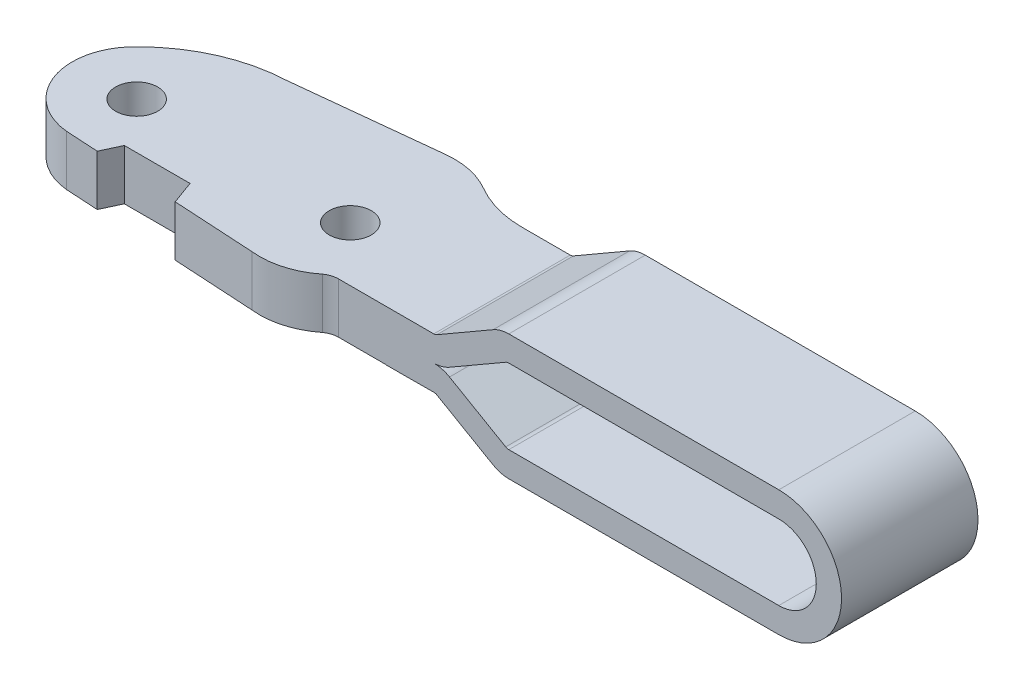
ISO-10303-21;
HEADER;
FILE_DESCRIPTION(('STEP AP214'),'2;1');
FILE_NAME('part.step','',(''),(''),'','','');
FILE_SCHEMA(('AUTOMOTIVE_DESIGN { 1 0 10303 214 1 1 1 1 }'));
ENDSEC;
DATA;
#1=APPLICATION_CONTEXT('core data for automotive mechanical design processes');
#2=APPLICATION_PROTOCOL_DEFINITION('international standard','automotive_design',2000,#1);
#3=PRODUCT_CONTEXT('',#1,'mechanical');
#4=PRODUCT('Part','Part','',(#3));
#5=PRODUCT_RELATED_PRODUCT_CATEGORY('part','',(#4));
#6=PRODUCT_DEFINITION_FORMATION('','',#4);
#7=PRODUCT_DEFINITION_CONTEXT('part definition',#1,'design');
#8=PRODUCT_DEFINITION('design','',#6,#7);
#9=PRODUCT_DEFINITION_SHAPE('','',#8);
#10=(LENGTH_UNIT() NAMED_UNIT(*) SI_UNIT(.MILLI.,.METRE.));
#11=(NAMED_UNIT(*) PLANE_ANGLE_UNIT() SI_UNIT($,.RADIAN.));
#12=(NAMED_UNIT(*) SI_UNIT($,.STERADIAN.) SOLID_ANGLE_UNIT());
#13=UNCERTAINTY_MEASURE_WITH_UNIT(LENGTH_MEASURE(1.E-05),#10,'distance_accuracy_value','');
#14=(GEOMETRIC_REPRESENTATION_CONTEXT(3) GLOBAL_UNCERTAINTY_ASSIGNED_CONTEXT((#13)) GLOBAL_UNIT_ASSIGNED_CONTEXT((#10,
#11,#12)) REPRESENTATION_CONTEXT('',''));
#15=CARTESIAN_POINT('',(0.,0.,0.));
#16=DIRECTION('',(0.,0.,1.));
#17=DIRECTION('',(1.,0.,0.));
#18=AXIS2_PLACEMENT_3D('',#15,#16,#17);
#19=CARTESIAN_POINT('',(30.4880652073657,3.,9.03999999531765));
#20=DIRECTION('',(0.,1.,0.));
#21=DIRECTION('',(-1.,0.,0.));
#22=AXIS2_PLACEMENT_3D('',#19,#20,#21);
#23=PLANE('',#22);
#24=DIRECTION('',(-1.,0.,0.));
#25=VECTOR('',#24,1.);
#26=CARTESIAN_POINT('',(41.7740915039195,3.,-9.7));
#27=LINE('',#26,#25);
#28=CARTESIAN_POINT('',(41.7740915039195,3.00000000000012,-9.7));
#29=VERTEX_POINT('',#28);
#30=CARTESIAN_POINT('',(36.0727132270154,3.00000000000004,-9.7));
#31=VERTEX_POINT('',#30);
#32=EDGE_CURVE('E240',#29,#31,#27,.T.);
#33=ORIENTED_EDGE('',*,*,#32,.T.);
#34=CARTESIAN_POINT('',(36.0727132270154,3.00000000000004,-22.146));
#35=DIRECTION('',(0.,-1.,0.));
#36=DIRECTION('',(-1.,0.,0.));
#37=AXIS2_PLACEMENT_3D('',#34,#35,#36);
#38=CIRCLE('',#37,12.446);
#39=CARTESIAN_POINT('',(29.7777756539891,3.,-11.409302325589));
#40=VERTEX_POINT('',#39);
#41=EDGE_CURVE('E237',#31,#40,#38,.T.);
#42=ORIENTED_EDGE('',*,*,#41,.T.);
#43=CARTESIAN_POINT('',(25.0244554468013,3.,-3.3020000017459));
#44=DIRECTION('',(0.,1.,0.));
#45=DIRECTION('',(-1.,0.,0.));
#46=AXIS2_PLACEMENT_3D('',#43,#44,#45);
#47=CIRCLE('',#46,9.39799999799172);
#48=CARTESIAN_POINT('',(24.0237144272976,3.,-12.6465664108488));
#49=VERTEX_POINT('',#48);
#50=EDGE_CURVE('E239',#40,#49,#47,.T.);
#51=ORIENTED_EDGE('',*,*,#50,.T.);
#52=DIRECTION('',(-0.994314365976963,0.,0.106484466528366));
#53=VECTOR('',#52,1.);
#54=CARTESIAN_POINT('',(24.0237144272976,3.,-12.6465664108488));
#55=LINE('',#54,#53);
#56=CARTESIAN_POINT('',(6.9898588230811,3.,-10.8223535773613));
#57=VERTEX_POINT('',#56);
#58=EDGE_CURVE('E242',#49,#57,#55,.T.);
#59=ORIENTED_EDGE('',*,*,#58,.T.);
#60=CARTESIAN_POINT('',(7.76309652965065,3.,7.71645072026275));
#61=DIRECTION('',(0.,1.,0.));
#62=DIRECTION('',(-1.,0.,0.));
#63=AXIS2_PLACEMENT_3D('',#60,#61,#62);
#64=CIRCLE('',#63,18.5549228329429);
#65=CARTESIAN_POINT('',(-5.28278726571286,3.,-5.47786916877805));
#66=VERTEX_POINT('',#65);
#67=EDGE_CURVE('E248',#57,#66,#64,.T.);
#68=ORIENTED_EDGE('',*,*,#67,.T.);
#69=CARTESIAN_POINT('',(-0.160000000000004,3.00000000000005,0.));
#70=DIRECTION('',(0.,1.,0.));
#71=DIRECTION('',(-1.,0.,0.));
#72=AXIS2_PLACEMENT_3D('',#69,#70,#71);
#73=CIRCLE('',#72,7.5);
#74=CARTESIAN_POINT('',(-0.841685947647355,3.,7.46895603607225));
#75=VERTEX_POINT('',#74);
#76=EDGE_CURVE('E250',#66,#75,#73,.T.);
#77=ORIENTED_EDGE('',*,*,#76,.T.);
#78=DIRECTION('',(0.99828955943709,0.,0.0584632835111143));
#79=VECTOR('',#78,1.);
#80=CARTESIAN_POINT('',(-0.841685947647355,3.00000000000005,7.46895603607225));
#81=LINE('',#80,#79);
#82=CARTESIAN_POINT('',(3.01649914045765,3.00000000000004,7.6949046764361));
#83=VERTEX_POINT('',#82);
#84=EDGE_CURVE('E252',#75,#83,#81,.T.);
#85=ORIENTED_EDGE('',*,*,#84,.T.);
#86=DIRECTION('',(0.422618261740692,0.,-0.906307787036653));
#87=VECTOR('',#86,1.);
#88=CARTESIAN_POINT('',(3.01649914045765,3.00000000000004,7.6949046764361));
#89=LINE('',#88,#87);
#90=CARTESIAN_POINT('',(4.04,3.,5.5));
#91=VERTEX_POINT('',#90);
#92=EDGE_CURVE('E254',#83,#91,#89,.T.);
#93=ORIENTED_EDGE('',*,*,#92,.T.);
#94=DIRECTION('',(1.,0.,0.));
#95=VECTOR('',#94,1.);
#96=CARTESIAN_POINT('',(4.04,3.,5.5));
#97=LINE('',#96,#95);
#98=CARTESIAN_POINT('',(11.84,3.,5.5));
#99=VERTEX_POINT('',#98);
#100=EDGE_CURVE('E125',#91,#99,#97,.T.);
#101=ORIENTED_EDGE('',*,*,#100,.T.);
#102=DIRECTION('',(0.342020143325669,0.,0.939692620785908));
#103=VECTOR('',#102,1.);
#104=CARTESIAN_POINT('',(11.84,3.,5.5));
#105=LINE('',#104,#103);
#106=CARTESIAN_POINT('',(12.8484515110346,3.,8.2706977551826));
#107=VERTEX_POINT('',#106);
#108=EDGE_CURVE('E119',#99,#107,#105,.T.);
#109=ORIENTED_EDGE('',*,*,#108,.T.);
#110=DIRECTION('',(0.99828955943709,0.,0.0584632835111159));
#111=VECTOR('',#110,1.);
#112=CARTESIAN_POINT('',(12.8484515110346,3.,8.2706977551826));
#113=LINE('',#112,#111);
#114=CARTESIAN_POINT('',(22.54609512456,3.,8.83862524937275));
#115=VERTEX_POINT('',#114);
#116=EDGE_CURVE('E123',#107,#115,#113,.T.);
#117=ORIENTED_EDGE('',*,*,#116,.T.);
#118=CARTESIAN_POINT('',(23.5004554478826,3.,0.));
#119=DIRECTION('',(0.,1.,0.));
#120=DIRECTION('',(-1.,0.,0.));
#121=AXIS2_PLACEMENT_3D('',#118,#119,#120);
#122=CIRCLE('',#121,8.88999999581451);
#123=CARTESIAN_POINT('',(29.0389211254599,3.,6.95395555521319));
#124=VERTEX_POINT('',#123);
#125=EDGE_CURVE('E31',#115,#124,#122,.T.);
#126=ORIENTED_EDGE('',*,*,#125,.T.);
#127=CARTESIAN_POINT('',(30.4880652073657,3.,9.03999999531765));
#128=DIRECTION('',(0.,-1.,0.));
#129=DIRECTION('',(-1.,0.,0.));
#130=AXIS2_PLACEMENT_3D('',#127,#128,#129);
#131=CIRCLE('',#130,2.53999999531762);
#132=CARTESIAN_POINT('',(30.4880652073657,3.,6.5));
#133=VERTEX_POINT('',#132);
#134=EDGE_CURVE('E170',#124,#133,#131,.T.);
#135=ORIENTED_EDGE('',*,*,#134,.T.);
#136=DIRECTION('',(1.,0.,0.));
#137=VECTOR('',#136,1.);
#138=CARTESIAN_POINT('',(30.4880652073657,3.,6.5));
#139=LINE('',#138,#137);
#140=CARTESIAN_POINT('',(41.7740915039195,3.00000000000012,6.5));
#141=VERTEX_POINT('',#140);
#142=EDGE_CURVE('E88',#133,#141,#139,.T.);
#143=ORIENTED_EDGE('',*,*,#142,.T.);
#144=DIRECTION('',(0.,0.,-1.));
#145=VECTOR('',#144,1.);
#146=CARTESIAN_POINT('',(41.7740915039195,3.00000000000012,62.6257110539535));
#147=LINE('',#146,#145);
#148=EDGE_CURVE('E692',#141,#29,#147,.T.);
#149=ORIENTED_EDGE('',*,*,#148,.T.);
#150=EDGE_LOOP('',(#33,#42,#51,#59,#68,#77,#85,#93,#101,#109,#117,#126,#135,#143,#149));
#151=FACE_BOUND('',#150,.T.);
#152=CARTESIAN_POINT('',(25.4,3.,0.0399999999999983));
#153=DIRECTION('',(0.,1.,0.));
#154=DIRECTION('',(-1.,0.,0.));
#155=AXIS2_PLACEMENT_3D('',#152,#153,#154);
#156=CIRCLE('',#155,2.5);
#157=CARTESIAN_POINT('',(22.9,3.,0.0399999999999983));
#158=VERTEX_POINT('',#157);
#159=EDGE_CURVE('E147',#158,#158,#156,.T.);
#160=ORIENTED_EDGE('',*,*,#159,.F.);
#161=EDGE_LOOP('',(#160));
#162=FACE_BOUND('',#161,.T.);
#163=CARTESIAN_POINT('',(0.,3.00000000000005,0.));
#164=DIRECTION('',(0.,1.,0.));
#165=DIRECTION('',(-1.,0.,0.));
#166=AXIS2_PLACEMENT_3D('',#163,#164,#165);
#167=CIRCLE('',#166,2.5);
#168=CARTESIAN_POINT('',(-2.5,3.00000000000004,0.));
#169=VERTEX_POINT('',#168);
#170=EDGE_CURVE('E677',#169,#169,#167,.T.);
#171=ORIENTED_EDGE('',*,*,#170,.F.);
#172=EDGE_LOOP('',(#171));
#173=FACE_BOUND('',#172,.T.);
#174=ADVANCED_FACE('F14',(#151,#162,#173),#23,.T.);
#175=CARTESIAN_POINT('',(30.4880652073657,-3.,9.03999999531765));
#176=DIRECTION('',(0.,1.,0.));
#177=DIRECTION('',(-1.,0.,0.));
#178=AXIS2_PLACEMENT_3D('',#175,#176,#177);
#179=PLANE('',#178);
#180=CARTESIAN_POINT('',(36.0727132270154,-3.,-22.146));
#181=DIRECTION('',(0.,-1.,0.));
#182=DIRECTION('',(-1.,0.,0.));
#183=AXIS2_PLACEMENT_3D('',#180,#181,#182);
#184=CIRCLE('',#183,12.446);
#185=CARTESIAN_POINT('',(36.0727132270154,-3.,-9.7));
#186=VERTEX_POINT('',#185);
#187=CARTESIAN_POINT('',(29.7777756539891,-3.,-11.409302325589));
#188=VERTEX_POINT('',#187);
#189=EDGE_CURVE('E150',#186,#188,#184,.T.);
#190=ORIENTED_EDGE('',*,*,#189,.F.);
#191=DIRECTION('',(0.,0.,1.));
#192=VECTOR('',#191,1.);
#193=CARTESIAN_POINT('',(36.0727132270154,-3.,9.03999999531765));
#194=LINE('',#193,#192);
#195=CARTESIAN_POINT('',(36.0727132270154,-3.,6.5));
#196=VERTEX_POINT('',#195);
#197=EDGE_CURVE('E9',#186,#196,#194,.T.);
#198=ORIENTED_EDGE('',*,*,#197,.T.);
#199=DIRECTION('',(1.,0.,0.));
#200=VECTOR('',#199,1.);
#201=CARTESIAN_POINT('',(30.4880652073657,-3.,6.5));
#202=LINE('',#201,#200);
#203=CARTESIAN_POINT('',(30.4880652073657,-3.,6.5));
#204=VERTEX_POINT('',#203);
#205=EDGE_CURVE('E146',#204,#196,#202,.T.);
#206=ORIENTED_EDGE('',*,*,#205,.F.);
#207=CARTESIAN_POINT('',(30.4880652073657,-3.,9.03999999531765));
#208=DIRECTION('',(0.,-1.,0.));
#209=DIRECTION('',(-1.,0.,0.));
#210=AXIS2_PLACEMENT_3D('',#207,#208,#209);
#211=CIRCLE('',#210,2.53999999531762);
#212=CARTESIAN_POINT('',(29.0389211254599,-3.,6.95395555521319));
#213=VERTEX_POINT('',#212);
#214=EDGE_CURVE('E143',#213,#204,#211,.T.);
#215=ORIENTED_EDGE('',*,*,#214,.F.);
#216=CARTESIAN_POINT('',(23.5004554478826,-3.,0.));
#217=DIRECTION('',(0.,1.,0.));
#218=DIRECTION('',(-1.,0.,0.));
#219=AXIS2_PLACEMENT_3D('',#216,#217,#218);
#220=CIRCLE('',#219,8.88999999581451);
#221=CARTESIAN_POINT('',(22.54609512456,-3.,8.83862524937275));
#222=VERTEX_POINT('',#221);
#223=EDGE_CURVE('E79',#222,#213,#220,.T.);
#224=ORIENTED_EDGE('',*,*,#223,.F.);
#225=DIRECTION('',(0.99828955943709,0.,0.0584632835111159));
#226=VECTOR('',#225,1.);
#227=CARTESIAN_POINT('',(12.8484515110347,-3.,8.2706977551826));
#228=LINE('',#227,#226);
#229=CARTESIAN_POINT('',(12.8484515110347,-3.,8.2706977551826));
#230=VERTEX_POINT('',#229);
#231=EDGE_CURVE('E73',#230,#222,#228,.T.);
#232=ORIENTED_EDGE('',*,*,#231,.F.);
#233=DIRECTION('',(0.342020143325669,0.,0.939692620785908));
#234=VECTOR('',#233,1.);
#235=CARTESIAN_POINT('',(11.84,-3.,5.5));
#236=LINE('',#235,#234);
#237=CARTESIAN_POINT('',(11.84,-3.,5.5));
#238=VERTEX_POINT('',#237);
#239=EDGE_CURVE('E133',#238,#230,#236,.T.);
#240=ORIENTED_EDGE('',*,*,#239,.F.);
#241=DIRECTION('',(1.,0.,0.));
#242=VECTOR('',#241,1.);
#243=CARTESIAN_POINT('',(4.04,-3.,5.5));
#244=LINE('',#243,#242);
#245=CARTESIAN_POINT('',(4.04,-3.,5.5));
#246=VERTEX_POINT('',#245);
#247=EDGE_CURVE('E165',#246,#238,#244,.T.);
#248=ORIENTED_EDGE('',*,*,#247,.F.);
#249=DIRECTION('',(0.422618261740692,0.,-0.906307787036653));
#250=VECTOR('',#249,1.);
#251=CARTESIAN_POINT('',(3.01649914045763,-3.,7.6949046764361));
#252=LINE('',#251,#250);
#253=CARTESIAN_POINT('',(3.01649914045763,-3.,7.6949046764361));
#254=VERTEX_POINT('',#253);
#255=EDGE_CURVE('E163',#254,#246,#252,.T.);
#256=ORIENTED_EDGE('',*,*,#255,.F.);
#257=DIRECTION('',(0.99828955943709,0.,0.0584632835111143));
#258=VECTOR('',#257,1.);
#259=CARTESIAN_POINT('',(-0.841685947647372,-3.,7.46895603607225));
#260=LINE('',#259,#258);
#261=CARTESIAN_POINT('',(-0.841685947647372,-3.,7.46895603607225));
#262=VERTEX_POINT('',#261);
#263=EDGE_CURVE('E161',#262,#254,#260,.T.);
#264=ORIENTED_EDGE('',*,*,#263,.F.);
#265=CARTESIAN_POINT('',(-0.160000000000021,-3.,0.));
#266=DIRECTION('',(0.,1.,0.));
#267=DIRECTION('',(-1.,0.,0.));
#268=AXIS2_PLACEMENT_3D('',#265,#266,#267);
#269=CIRCLE('',#268,7.5);
#270=CARTESIAN_POINT('',(-5.28278726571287,-3.,-5.47786916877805));
#271=VERTEX_POINT('',#270);
#272=EDGE_CURVE('E159',#271,#262,#269,.T.);
#273=ORIENTED_EDGE('',*,*,#272,.F.);
#274=CARTESIAN_POINT('',(7.76309652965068,-3.,7.71645072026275));
#275=DIRECTION('',(0.,1.,0.));
#276=DIRECTION('',(-1.,0.,0.));
#277=AXIS2_PLACEMENT_3D('',#274,#275,#276);
#278=CIRCLE('',#277,18.5549228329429);
#279=CARTESIAN_POINT('',(6.98985882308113,-3.,-10.8223535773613));
#280=VERTEX_POINT('',#279);
#281=EDGE_CURVE('E156',#280,#271,#278,.T.);
#282=ORIENTED_EDGE('',*,*,#281,.F.);
#283=DIRECTION('',(-0.994314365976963,0.,0.106484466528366));
#284=VECTOR('',#283,1.);
#285=CARTESIAN_POINT('',(24.0237144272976,-3.,-12.6465664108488));
#286=LINE('',#285,#284);
#287=CARTESIAN_POINT('',(24.0237144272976,-3.,-12.6465664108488));
#288=VERTEX_POINT('',#287);
#289=EDGE_CURVE('E154',#288,#280,#286,.T.);
#290=ORIENTED_EDGE('',*,*,#289,.F.);
#291=CARTESIAN_POINT('',(25.0244554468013,-3.,-3.3020000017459));
#292=DIRECTION('',(0.,1.,0.));
#293=DIRECTION('',(-1.,0.,0.));
#294=AXIS2_PLACEMENT_3D('',#291,#292,#293);
#295=CIRCLE('',#294,9.39799999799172);
#296=EDGE_CURVE('E152',#188,#288,#295,.T.);
#297=ORIENTED_EDGE('',*,*,#296,.F.);
#298=EDGE_LOOP('',(#190,#198,#206,#215,#224,#232,#240,#248,#256,#264,#273,#282,#290,#297));
#299=FACE_BOUND('',#298,.T.);
#300=CARTESIAN_POINT('',(25.4,-3.,0.0399999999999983));
#301=DIRECTION('',(0.,1.,0.));
#302=DIRECTION('',(-1.,0.,0.));
#303=AXIS2_PLACEMENT_3D('',#300,#301,#302);
#304=CIRCLE('',#303,2.5);
#305=CARTESIAN_POINT('',(22.9,-3.,0.0399999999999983));
#306=VERTEX_POINT('',#305);
#307=EDGE_CURVE('E680',#306,#306,#304,.T.);
#308=ORIENTED_EDGE('',*,*,#307,.T.);
#309=EDGE_LOOP('',(#308));
#310=FACE_BOUND('',#309,.T.);
#311=CARTESIAN_POINT('',(0.,-3.,0.));
#312=DIRECTION('',(0.,1.,0.));
#313=DIRECTION('',(-1.,0.,0.));
#314=AXIS2_PLACEMENT_3D('',#311,#312,#313);
#315=CIRCLE('',#314,2.5);
#316=CARTESIAN_POINT('',(-2.49999999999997,-3.,0.));
#317=VERTEX_POINT('',#316);
#318=EDGE_CURVE('E681',#317,#317,#315,.T.);
#319=ORIENTED_EDGE('',*,*,#318,.T.);
#320=EDGE_LOOP('',(#319));
#321=FACE_BOUND('',#320,.T.);
#322=ADVANCED_FACE('F206',(#299,#310,#321),#179,.F.);
#323=CARTESIAN_POINT('',(30.4880652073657,3.,9.03999999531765));
#324=DIRECTION('',(0.,-1.,0.));
#325=DIRECTION('',(1.,0.,0.));
#326=AXIS2_PLACEMENT_3D('',#323,#324,#325);
#327=CYLINDRICAL_SURFACE('',#326,2.53999999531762);
#328=ORIENTED_EDGE('',*,*,#214,.T.);
#329=DIRECTION('',(0.,-1.,0.));
#330=VECTOR('',#329,1.);
#331=CARTESIAN_POINT('',(30.4880652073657,3.,6.5));
#332=LINE('',#331,#330);
#333=EDGE_CURVE('E23',#133,#204,#332,.T.);
#334=ORIENTED_EDGE('',*,*,#333,.F.);
#335=ORIENTED_EDGE('',*,*,#134,.F.);
#336=DIRECTION('',(0.,-1.,0.));
#337=VECTOR('',#336,1.);
#338=CARTESIAN_POINT('',(29.0389211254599,3.,6.95395555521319));
#339=LINE('',#338,#337);
#340=EDGE_CURVE('E139',#124,#213,#339,.T.);
#341=ORIENTED_EDGE('',*,*,#340,.T.);
#342=EDGE_LOOP('',(#328,#334,#335,#341));
#343=FACE_BOUND('',#342,.T.);
#344=ADVANCED_FACE('F16',(#343),#327,.F.);
#345=CARTESIAN_POINT('',(30.4880652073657,3.,6.5));
#346=DIRECTION('',(0.,0.,-1.));
#347=DIRECTION('',(-1.,0.,0.));
#348=AXIS2_PLACEMENT_3D('',#345,#346,#347);
#349=PLANE('',#348);
#350=CARTESIAN_POINT('',(41.7740915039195,3.74000000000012,6.5));
#351=DIRECTION('',(0.,0.,-1.));
#352=DIRECTION('',(-1.,0.,0.));
#353=AXIS2_PLACEMENT_3D('',#350,#351,#352);
#354=CIRCLE('',#353,0.740000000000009);
#355=CARTESIAN_POINT('',(42.1440915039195,3.09914120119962,6.5));
#356=VERTEX_POINT('',#355);
#357=EDGE_CURVE('E665',#356,#141,#354,.T.);
#358=ORIENTED_EDGE('',*,*,#357,.T.);
#359=ORIENTED_EDGE('',*,*,#142,.F.);
#360=ORIENTED_EDGE('',*,*,#333,.T.);
#361=ORIENTED_EDGE('',*,*,#205,.T.);
#362=DIRECTION('',(0.,-1.,0.));
#363=VECTOR('',#362,1.);
#364=CARTESIAN_POINT('',(36.0727132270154,3.00000000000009,6.5));
#365=LINE('',#364,#363);
#366=CARTESIAN_POINT('',(36.0727132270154,-3.02521488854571,6.5));
#367=VERTEX_POINT('',#366);
#368=EDGE_CURVE('E219',#196,#367,#365,.T.);
#369=ORIENTED_EDGE('',*,*,#368,.T.);
#370=DIRECTION('',(0.999990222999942,0.00442197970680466,0.));
#371=VECTOR('',#370,1.);
#372=CARTESIAN_POINT('',(41.7748294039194,-2.99999999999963,6.5));
#373=LINE('',#372,#371);
#374=CARTESIAN_POINT('',(41.7748294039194,-2.99999999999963,6.5));
#375=VERTEX_POINT('',#374);
#376=EDGE_CURVE('E795',#367,#375,#373,.T.);
#377=ORIENTED_EDGE('',*,*,#376,.T.);
#378=CARTESIAN_POINT('',(41.7748294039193,-3.73999999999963,6.5));
#379=DIRECTION('',(0.,0.,-1.));
#380=DIRECTION('',(-1.,0.,0.));
#381=AXIS2_PLACEMENT_3D('',#378,#379,#380);
#382=CIRCLE('',#381,0.74);
#383=CARTESIAN_POINT('',(42.1448294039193,-3.09914120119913,6.5));
#384=VERTEX_POINT('',#383);
#385=EDGE_CURVE('E798',#375,#384,#382,.T.);
#386=ORIENTED_EDGE('',*,*,#385,.T.);
#387=DIRECTION('',(0.866025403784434,-0.500000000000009,0.));
#388=VECTOR('',#387,1.);
#389=CARTESIAN_POINT('',(48.8128678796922,-6.94893501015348,6.5));
#390=LINE('',#389,#388);
#391=CARTESIAN_POINT('',(48.8128678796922,-6.94893501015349,6.5));
#392=VERTEX_POINT('',#391);
#393=EDGE_CURVE('E801',#384,#392,#390,.T.);
#394=ORIENTED_EDGE('',*,*,#393,.T.);
#395=CARTESIAN_POINT('',(50.6828678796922,-3.70999999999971,6.5));
#396=DIRECTION('',(0.,0.,-1.));
#397=DIRECTION('',(-1.,0.,0.));
#398=AXIS2_PLACEMENT_3D('',#395,#396,#397);
#399=CIRCLE('',#398,3.74);
#400=CARTESIAN_POINT('',(50.6828678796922,-7.44999999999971,6.5));
#401=VERTEX_POINT('',#400);
#402=EDGE_CURVE('E804',#392,#401,#399,.F.);
#403=ORIENTED_EDGE('',*,*,#402,.T.);
#404=DIRECTION('',(1.,0.,0.));
#405=VECTOR('',#404,1.);
#406=CARTESIAN_POINT('',(82.7344997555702,-7.4499999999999,6.5));
#407=LINE('',#406,#405);
#408=CARTESIAN_POINT('',(82.7344997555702,-7.4499999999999,6.5));
#409=VERTEX_POINT('',#408);
#410=EDGE_CURVE('E807',#401,#409,#407,.T.);
#411=ORIENTED_EDGE('',*,*,#410,.T.);
#412=CARTESIAN_POINT('',(82.7344997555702,1.04083408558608E-13,6.5));
#413=DIRECTION('',(0.,0.,-1.));
#414=DIRECTION('',(-1.,0.,0.));
#415=AXIS2_PLACEMENT_3D('',#412,#413,#414);
#416=CIRCLE('',#415,7.45);
#417=CARTESIAN_POINT('',(82.7344997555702,7.4500000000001,6.5));
#418=VERTEX_POINT('',#417);
#419=EDGE_CURVE('E810',#409,#418,#416,.F.);
#420=ORIENTED_EDGE('',*,*,#419,.T.);
#421=DIRECTION('',(-1.,0.,0.));
#422=VECTOR('',#421,1.);
#423=CARTESIAN_POINT('',(50.6821299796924,7.45000000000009,6.5));
#424=LINE('',#423,#422);
#425=CARTESIAN_POINT('',(50.6821299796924,7.45000000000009,6.5));
#426=VERTEX_POINT('',#425);
#427=EDGE_CURVE('E813',#418,#426,#424,.T.);
#428=ORIENTED_EDGE('',*,*,#427,.T.);
#429=CARTESIAN_POINT('',(50.6821299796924,3.71000000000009,6.5));
#430=DIRECTION('',(0.,0.,-1.));
#431=DIRECTION('',(-1.,0.,0.));
#432=AXIS2_PLACEMENT_3D('',#429,#430,#431);
#433=CIRCLE('',#432,3.74);
#434=CARTESIAN_POINT('',(48.8121299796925,6.9489350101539,6.5));
#435=VERTEX_POINT('',#434);
#436=EDGE_CURVE('E816',#426,#435,#433,.F.);
#437=ORIENTED_EDGE('',*,*,#436,.T.);
#438=DIRECTION('',(-0.86602540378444,-0.5,0.));
#439=VECTOR('',#438,1.);
#440=CARTESIAN_POINT('',(42.1440915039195,3.09914120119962,6.5));
#441=LINE('',#440,#439);
#442=EDGE_CURVE('E668',#435,#356,#441,.T.);
#443=ORIENTED_EDGE('',*,*,#442,.T.);
#444=EDGE_LOOP('',(#358,#359,#360,#361,#369,#377,#386,#394,#403,#411,#420,#428,#437,#443));
#445=FACE_BOUND('',#444,.T.);
#446=CARTESIAN_POINT('',(41.7740915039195,3.74000000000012,6.5));
#447=DIRECTION('',(0.,0.,-1.));
#448=DIRECTION('',(-1.,0.,0.));
#449=AXIS2_PLACEMENT_3D('',#446,#447,#448);
#450=CIRCLE('',#449,3.74000000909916);
#451=CARTESIAN_POINT('',(43.6440915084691,0.501064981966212,6.5));
#452=VERTEX_POINT('',#451);
#453=CARTESIAN_POINT('',(41.7744604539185,9.09937056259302E-09,6.5));
#454=VERTEX_POINT('',#453);
#455=EDGE_CURVE('E661',#452,#454,#450,.T.);
#456=ORIENTED_EDGE('',*,*,#455,.F.);
#457=DIRECTION('',(-0.866025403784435,-0.500000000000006,0.));
#458=VECTOR('',#457,1.);
#459=CARTESIAN_POINT('',(43.6440915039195,0.501064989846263,6.5));
#460=LINE('',#459,#458);
#461=CARTESIAN_POINT('',(50.3121299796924,4.3508587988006,6.5));
#462=VERTEX_POINT('',#461);
#463=EDGE_CURVE('E820',#462,#452,#460,.T.);
#464=ORIENTED_EDGE('',*,*,#463,.F.);
#465=CARTESIAN_POINT('',(50.6821299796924,3.71000000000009,6.5));
#466=DIRECTION('',(0.,0.,-1.));
#467=DIRECTION('',(-1.,0.,0.));
#468=AXIS2_PLACEMENT_3D('',#465,#466,#467);
#469=CIRCLE('',#468,0.740000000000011);
#470=CARTESIAN_POINT('',(50.6821299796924,4.4500000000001,6.5));
#471=VERTEX_POINT('',#470);
#472=EDGE_CURVE('E837',#471,#462,#469,.F.);
#473=ORIENTED_EDGE('',*,*,#472,.F.);
#474=DIRECTION('',(-1.,0.,0.));
#475=VECTOR('',#474,1.);
#476=CARTESIAN_POINT('',(50.6821299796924,4.4500000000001,6.5));
#477=LINE('',#476,#475);
#478=CARTESIAN_POINT('',(82.7344997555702,4.4500000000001,6.5));
#479=VERTEX_POINT('',#478);
#480=EDGE_CURVE('E834',#479,#471,#477,.T.);
#481=ORIENTED_EDGE('',*,*,#480,.F.);
#482=CARTESIAN_POINT('',(82.7344997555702,1.04083408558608E-13,6.5));
#483=DIRECTION('',(0.,0.,-1.));
#484=DIRECTION('',(-1.,0.,0.));
#485=AXIS2_PLACEMENT_3D('',#482,#483,#484);
#486=CIRCLE('',#485,4.45);
#487=CARTESIAN_POINT('',(82.7344997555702,-4.44999999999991,6.5));
#488=VERTEX_POINT('',#487);
#489=EDGE_CURVE('E831',#488,#479,#486,.F.);
#490=ORIENTED_EDGE('',*,*,#489,.F.);
#491=DIRECTION('',(1.,0.,0.));
#492=VECTOR('',#491,1.);
#493=CARTESIAN_POINT('',(82.7344997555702,-4.44999999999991,6.5));
#494=LINE('',#493,#492);
#495=CARTESIAN_POINT('',(50.6828678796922,-4.44999999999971,6.5));
#496=VERTEX_POINT('',#495);
#497=EDGE_CURVE('E828',#496,#488,#494,.T.);
#498=ORIENTED_EDGE('',*,*,#497,.F.);
#499=CARTESIAN_POINT('',(50.6828678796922,-3.70999999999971,6.5));
#500=DIRECTION('',(0.,0.,-1.));
#501=DIRECTION('',(-1.,0.,0.));
#502=AXIS2_PLACEMENT_3D('',#499,#500,#501);
#503=CIRCLE('',#502,0.74);
#504=CARTESIAN_POINT('',(50.3128678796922,-4.35085879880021,6.5));
#505=VERTEX_POINT('',#504);
#506=EDGE_CURVE('E825',#505,#496,#503,.F.);
#507=ORIENTED_EDGE('',*,*,#506,.F.);
#508=DIRECTION('',(0.86602540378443,-0.500000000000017,0.));
#509=VECTOR('',#508,1.);
#510=CARTESIAN_POINT('',(50.3128678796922,-4.35085879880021,6.5));
#511=LINE('',#510,#509);
#512=CARTESIAN_POINT('',(43.6448294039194,-0.501064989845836,6.5));
#513=VERTEX_POINT('',#512);
#514=EDGE_CURVE('E822',#513,#505,#511,.T.);
#515=ORIENTED_EDGE('',*,*,#514,.F.);
#516=CARTESIAN_POINT('',(41.7748294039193,-3.73999999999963,6.5));
#517=DIRECTION('',(0.,0.,-1.));
#518=DIRECTION('',(-1.,0.,0.));
#519=AXIS2_PLACEMENT_3D('',#516,#517,#518);
#520=CIRCLE('',#519,3.74000000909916);
#521=EDGE_CURVE('E648',#454,#513,#520,.T.);
#522=ORIENTED_EDGE('',*,*,#521,.F.);
#523=EDGE_LOOP('',(#456,#464,#473,#481,#490,#498,#507,#515,#522));
#524=FACE_BOUND('',#523,.T.);
#525=ADVANCED_FACE('F198',(#445,#524),#349,.F.);
#526=CARTESIAN_POINT('',(41.7740915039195,3.,-9.7));
#527=DIRECTION('',(0.,0.,1.));
#528=DIRECTION('',(1.,0.,0.));
#529=AXIS2_PLACEMENT_3D('',#526,#527,#528);
#530=PLANE('',#529);
#531=ORIENTED_EDGE('',*,*,#32,.F.);
#532=CARTESIAN_POINT('',(41.7740915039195,3.74000000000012,-9.7));
#533=DIRECTION('',(0.,0.,1.));
#534=DIRECTION('',(0.,1.,0.));
#535=AXIS2_PLACEMENT_3D('',#532,#533,#534);
#536=CIRCLE('',#535,0.740000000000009);
#537=CARTESIAN_POINT('',(42.1440915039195,3.09914120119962,-9.7));
#538=VERTEX_POINT('',#537);
#539=EDGE_CURVE('E232',#29,#538,#536,.T.);
#540=ORIENTED_EDGE('',*,*,#539,.T.);
#541=DIRECTION('',(0.86602540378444,0.5,0.));
#542=VECTOR('',#541,1.);
#543=CARTESIAN_POINT('',(42.1440915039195,3.09914120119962,-9.7));
#544=LINE('',#543,#542);
#545=CARTESIAN_POINT('',(48.8121299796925,6.9489350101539,-9.7));
#546=VERTEX_POINT('',#545);
#547=EDGE_CURVE('E746',#538,#546,#544,.T.);
#548=ORIENTED_EDGE('',*,*,#547,.T.);
#549=CARTESIAN_POINT('',(50.6821299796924,3.71000000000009,-9.7));
#550=DIRECTION('',(0.,0.,-1.));
#551=DIRECTION('',(0.,1.,0.));
#552=AXIS2_PLACEMENT_3D('',#549,#550,#551);
#553=CIRCLE('',#552,3.74);
#554=CARTESIAN_POINT('',(50.6821299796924,7.45000000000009,-9.7));
#555=VERTEX_POINT('',#554);
#556=EDGE_CURVE('E743',#546,#555,#553,.T.);
#557=ORIENTED_EDGE('',*,*,#556,.T.);
#558=DIRECTION('',(1.,0.,0.));
#559=VECTOR('',#558,1.);
#560=CARTESIAN_POINT('',(50.6821299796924,7.45000000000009,-9.7));
#561=LINE('',#560,#559);
#562=CARTESIAN_POINT('',(82.7344997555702,7.4500000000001,-9.7));
#563=VERTEX_POINT('',#562);
#564=EDGE_CURVE('E740',#555,#563,#561,.T.);
#565=ORIENTED_EDGE('',*,*,#564,.T.);
#566=CARTESIAN_POINT('',(82.7344997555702,1.04083408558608E-13,-9.7));
#567=DIRECTION('',(0.,0.,-1.));
#568=DIRECTION('',(0.,1.,0.));
#569=AXIS2_PLACEMENT_3D('',#566,#567,#568);
#570=CIRCLE('',#569,7.45);
#571=CARTESIAN_POINT('',(82.7344997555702,-7.4499999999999,-9.7));
#572=VERTEX_POINT('',#571);
#573=EDGE_CURVE('E737',#563,#572,#570,.T.);
#574=ORIENTED_EDGE('',*,*,#573,.T.);
#575=DIRECTION('',(-1.,0.,0.));
#576=VECTOR('',#575,1.);
#577=CARTESIAN_POINT('',(82.7344997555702,-7.4499999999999,-9.7));
#578=LINE('',#577,#576);
#579=CARTESIAN_POINT('',(50.6828678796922,-7.44999999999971,-9.7));
#580=VERTEX_POINT('',#579);
#581=EDGE_CURVE('E734',#572,#580,#578,.T.);
#582=ORIENTED_EDGE('',*,*,#581,.T.);
#583=CARTESIAN_POINT('',(50.6828678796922,-3.70999999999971,-9.7));
#584=DIRECTION('',(0.,0.,-1.));
#585=DIRECTION('',(0.,1.,0.));
#586=AXIS2_PLACEMENT_3D('',#583,#584,#585);
#587=CIRCLE('',#586,3.74);
#588=CARTESIAN_POINT('',(48.8128678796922,-6.94893501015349,-9.7));
#589=VERTEX_POINT('',#588);
#590=EDGE_CURVE('E731',#580,#589,#587,.T.);
#591=ORIENTED_EDGE('',*,*,#590,.T.);
#592=DIRECTION('',(-0.866025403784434,0.500000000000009,0.));
#593=VECTOR('',#592,1.);
#594=CARTESIAN_POINT('',(48.8128678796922,-6.94893501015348,-9.7));
#595=LINE('',#594,#593);
#596=CARTESIAN_POINT('',(42.1448294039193,-3.09914120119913,-9.7));
#597=VERTEX_POINT('',#596);
#598=EDGE_CURVE('E728',#589,#597,#595,.T.);
#599=ORIENTED_EDGE('',*,*,#598,.T.);
#600=CARTESIAN_POINT('',(41.7748294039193,-3.73999999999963,-9.7));
#601=DIRECTION('',(0.,0.,1.));
#602=DIRECTION('',(0.,1.,0.));
#603=AXIS2_PLACEMENT_3D('',#600,#601,#602);
#604=CIRCLE('',#603,0.74);
#605=CARTESIAN_POINT('',(41.7748294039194,-2.99999999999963,-9.7));
#606=VERTEX_POINT('',#605);
#607=EDGE_CURVE('E706',#597,#606,#604,.T.);
#608=ORIENTED_EDGE('',*,*,#607,.T.);
#609=DIRECTION('',(-0.999990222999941,-0.00442197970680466,0.));
#610=VECTOR('',#609,1.);
#611=CARTESIAN_POINT('',(41.7748294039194,-2.99999999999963,-9.7));
#612=LINE('',#611,#610);
#613=CARTESIAN_POINT('',(36.0727132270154,-3.02521488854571,-9.7));
#614=VERTEX_POINT('',#613);
#615=EDGE_CURVE('E230',#606,#614,#612,.T.);
#616=ORIENTED_EDGE('',*,*,#615,.T.);
#617=DIRECTION('',(0.,1.,0.));
#618=VECTOR('',#617,1.);
#619=CARTESIAN_POINT('',(36.0727132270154,3.00000000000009,-9.7));
#620=LINE('',#619,#618);
#621=EDGE_CURVE('E218',#614,#186,#620,.T.);
#622=ORIENTED_EDGE('',*,*,#621,.T.);
#623=DIRECTION('',(0.,-1.,0.));
#624=VECTOR('',#623,1.);
#625=CARTESIAN_POINT('',(36.0727132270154,3.00000000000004,-9.7));
#626=LINE('',#625,#624);
#627=EDGE_CURVE('E195',#31,#186,#626,.T.);
#628=ORIENTED_EDGE('',*,*,#627,.F.);
#629=EDGE_LOOP('',(#531,#540,#548,#557,#565,#574,#582,#591,#599,#608,#616,#622,#628));
#630=FACE_BOUND('',#629,.T.);
#631=CARTESIAN_POINT('',(41.7748294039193,-3.73999999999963,-9.7));
#632=DIRECTION('',(0.,0.,1.));
#633=DIRECTION('',(0.,1.,0.));
#634=AXIS2_PLACEMENT_3D('',#631,#632,#633);
#635=CIRCLE('',#634,3.74000000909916);
#636=CARTESIAN_POINT('',(43.6448294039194,-0.501064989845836,-9.7));
#637=VERTEX_POINT('',#636);
#638=CARTESIAN_POINT('',(41.7744604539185,9.09937056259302E-09,-9.7));
#639=VERTEX_POINT('',#638);
#640=EDGE_CURVE('E651',#637,#639,#635,.T.);
#641=ORIENTED_EDGE('',*,*,#640,.F.);
#642=DIRECTION('',(-0.866025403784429,0.500000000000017,0.));
#643=VECTOR('',#642,1.);
#644=CARTESIAN_POINT('',(50.3128678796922,-4.35085879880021,-9.7));
#645=LINE('',#644,#643);
#646=CARTESIAN_POINT('',(50.3128678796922,-4.35085879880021,-9.7));
#647=VERTEX_POINT('',#646);
#648=EDGE_CURVE('E657',#647,#637,#645,.T.);
#649=ORIENTED_EDGE('',*,*,#648,.F.);
#650=CARTESIAN_POINT('',(50.6828678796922,-3.70999999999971,-9.7));
#651=DIRECTION('',(0.,0.,-1.));
#652=DIRECTION('',(0.,1.,0.));
#653=AXIS2_PLACEMENT_3D('',#650,#651,#652);
#654=CIRCLE('',#653,0.74);
#655=CARTESIAN_POINT('',(50.6828678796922,-4.44999999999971,-9.7));
#656=VERTEX_POINT('',#655);
#657=EDGE_CURVE('E774',#656,#647,#654,.T.);
#658=ORIENTED_EDGE('',*,*,#657,.F.);
#659=DIRECTION('',(-1.,0.,0.));
#660=VECTOR('',#659,1.);
#661=CARTESIAN_POINT('',(82.7344997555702,-4.44999999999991,-9.7));
#662=LINE('',#661,#660);
#663=CARTESIAN_POINT('',(82.7344997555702,-4.44999999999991,-9.7));
#664=VERTEX_POINT('',#663);
#665=EDGE_CURVE('E777',#664,#656,#662,.T.);
#666=ORIENTED_EDGE('',*,*,#665,.F.);
#667=CARTESIAN_POINT('',(82.7344997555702,1.04083408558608E-13,-9.7));
#668=DIRECTION('',(0.,0.,-1.));
#669=DIRECTION('',(0.,1.,0.));
#670=AXIS2_PLACEMENT_3D('',#667,#668,#669);
#671=CIRCLE('',#670,4.45);
#672=CARTESIAN_POINT('',(82.7344997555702,4.4500000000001,-9.7));
#673=VERTEX_POINT('',#672);
#674=EDGE_CURVE('E780',#673,#664,#671,.T.);
#675=ORIENTED_EDGE('',*,*,#674,.F.);
#676=DIRECTION('',(1.,0.,0.));
#677=VECTOR('',#676,1.);
#678=CARTESIAN_POINT('',(50.6821299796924,4.4500000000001,-9.7));
#679=LINE('',#678,#677);
#680=CARTESIAN_POINT('',(50.6821299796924,4.4500000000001,-9.7));
#681=VERTEX_POINT('',#680);
#682=EDGE_CURVE('E783',#681,#673,#679,.T.);
#683=ORIENTED_EDGE('',*,*,#682,.F.);
#684=CARTESIAN_POINT('',(50.6821299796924,3.71000000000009,-9.7));
#685=DIRECTION('',(0.,0.,-1.));
#686=DIRECTION('',(0.,1.,0.));
#687=AXIS2_PLACEMENT_3D('',#684,#685,#686);
#688=CIRCLE('',#687,0.740000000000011);
#689=CARTESIAN_POINT('',(50.3121299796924,4.3508587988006,-9.7));
#690=VERTEX_POINT('',#689);
#691=EDGE_CURVE('E786',#690,#681,#688,.T.);
#692=ORIENTED_EDGE('',*,*,#691,.F.);
#693=DIRECTION('',(0.866025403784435,0.500000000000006,0.));
#694=VECTOR('',#693,1.);
#695=CARTESIAN_POINT('',(43.6440915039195,0.501064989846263,-9.7));
#696=LINE('',#695,#694);
#697=CARTESIAN_POINT('',(43.6440915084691,0.501064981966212,-9.7));
#698=VERTEX_POINT('',#697);
#699=EDGE_CURVE('E789',#698,#690,#696,.T.);
#700=ORIENTED_EDGE('',*,*,#699,.F.);
#701=CARTESIAN_POINT('',(41.7740915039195,3.74000000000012,-9.7));
#702=DIRECTION('',(0.,0.,1.));
#703=DIRECTION('',(0.,1.,0.));
#704=AXIS2_PLACEMENT_3D('',#701,#702,#703);
#705=CIRCLE('',#704,3.74000000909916);
#706=EDGE_CURVE('E792',#639,#698,#705,.T.);
#707=ORIENTED_EDGE('',*,*,#706,.F.);
#708=EDGE_LOOP('',(#641,#649,#658,#666,#675,#683,#692,#700,#707));
#709=FACE_BOUND('',#708,.T.);
#710=ADVANCED_FACE('F225',(#630,#709),#530,.F.);
#711=CARTESIAN_POINT('',(36.0727132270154,3.00000000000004,-22.146));
#712=DIRECTION('',(0.,-1.,0.));
#713=DIRECTION('',(1.,0.,0.));
#714=AXIS2_PLACEMENT_3D('',#711,#712,#713);
#715=CYLINDRICAL_SURFACE('',#714,12.446);
#716=ORIENTED_EDGE('',*,*,#189,.T.);
#717=DIRECTION('',(0.,-1.,0.));
#718=VECTOR('',#717,1.);
#719=CARTESIAN_POINT('',(29.7777756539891,3.,-11.409302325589));
#720=LINE('',#719,#718);
#721=EDGE_CURVE('E192',#40,#188,#720,.T.);
#722=ORIENTED_EDGE('',*,*,#721,.F.);
#723=ORIENTED_EDGE('',*,*,#41,.F.);
#724=ORIENTED_EDGE('',*,*,#627,.T.);
#725=EDGE_LOOP('',(#716,#722,#723,#724));
#726=FACE_BOUND('',#725,.T.);
#727=ADVANCED_FACE('F235',(#726),#715,.F.);
#728=CARTESIAN_POINT('',(25.0244554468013,3.,-3.3020000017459));
#729=DIRECTION('',(0.,-1.,0.));
#730=DIRECTION('',(1.,0.,0.));
#731=AXIS2_PLACEMENT_3D('',#728,#729,#730);
#732=CYLINDRICAL_SURFACE('',#731,9.39799999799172);
#733=ORIENTED_EDGE('',*,*,#296,.T.);
#734=DIRECTION('',(0.,-1.,0.));
#735=VECTOR('',#734,1.);
#736=CARTESIAN_POINT('',(24.0237144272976,3.,-12.6465664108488));
#737=LINE('',#736,#735);
#738=EDGE_CURVE('E189',#49,#288,#737,.T.);
#739=ORIENTED_EDGE('',*,*,#738,.F.);
#740=ORIENTED_EDGE('',*,*,#50,.F.);
#741=ORIENTED_EDGE('',*,*,#721,.T.);
#742=EDGE_LOOP('',(#733,#739,#740,#741));
#743=FACE_BOUND('',#742,.T.);
#744=ADVANCED_FACE('F284',(#743),#732,.T.);
#745=CARTESIAN_POINT('',(24.0237144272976,3.,-12.6465664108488));
#746=DIRECTION('',(0.106484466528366,0.,0.994314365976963));
#747=DIRECTION('',(0.994314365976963,0.,-0.106484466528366));
#748=AXIS2_PLACEMENT_3D('',#745,#746,#747);
#749=PLANE('',#748);
#750=ORIENTED_EDGE('',*,*,#289,.T.);
#751=DIRECTION('',(0.,-1.,0.));
#752=VECTOR('',#751,1.);
#753=CARTESIAN_POINT('',(6.9898588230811,3.,-10.8223535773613));
#754=LINE('',#753,#752);
#755=EDGE_CURVE('E186',#57,#280,#754,.T.);
#756=ORIENTED_EDGE('',*,*,#755,.F.);
#757=ORIENTED_EDGE('',*,*,#58,.F.);
#758=ORIENTED_EDGE('',*,*,#738,.T.);
#759=EDGE_LOOP('',(#750,#756,#757,#758));
#760=FACE_BOUND('',#759,.T.);
#761=ADVANCED_FACE('F280',(#760),#749,.F.);
#762=CARTESIAN_POINT('',(7.76309652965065,3.,7.71645072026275));
#763=DIRECTION('',(0.,-1.,0.));
#764=DIRECTION('',(1.,0.,0.));
#765=AXIS2_PLACEMENT_3D('',#762,#763,#764);
#766=CYLINDRICAL_SURFACE('',#765,18.5549228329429);
#767=ORIENTED_EDGE('',*,*,#281,.T.);
#768=DIRECTION('',(0.,-1.,0.));
#769=VECTOR('',#768,1.);
#770=CARTESIAN_POINT('',(-5.28278726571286,3.,-5.47786916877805));
#771=LINE('',#770,#769);
#772=EDGE_CURVE('E183',#66,#271,#771,.T.);
#773=ORIENTED_EDGE('',*,*,#772,.F.);
#774=ORIENTED_EDGE('',*,*,#67,.F.);
#775=ORIENTED_EDGE('',*,*,#755,.T.);
#776=EDGE_LOOP('',(#767,#773,#774,#775));
#777=FACE_BOUND('',#776,.T.);
#778=ADVANCED_FACE('F276',(#777),#766,.T.);
#779=CARTESIAN_POINT('',(-0.160000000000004,3.00000000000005,0.));
#780=DIRECTION('',(0.,-1.,0.));
#781=DIRECTION('',(1.,0.,0.));
#782=AXIS2_PLACEMENT_3D('',#779,#780,#781);
#783=CYLINDRICAL_SURFACE('',#782,7.5);
#784=ORIENTED_EDGE('',*,*,#272,.T.);
#785=DIRECTION('',(0.,-1.,0.));
#786=VECTOR('',#785,1.);
#787=CARTESIAN_POINT('',(-0.841685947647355,3.,7.46895603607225));
#788=LINE('',#787,#786);
#789=EDGE_CURVE('E180',#75,#262,#788,.T.);
#790=ORIENTED_EDGE('',*,*,#789,.F.);
#791=ORIENTED_EDGE('',*,*,#76,.F.);
#792=ORIENTED_EDGE('',*,*,#772,.T.);
#793=EDGE_LOOP('',(#784,#790,#791,#792));
#794=FACE_BOUND('',#793,.T.);
#795=ADVANCED_FACE('F272',(#794),#783,.T.);
#796=CARTESIAN_POINT('',(-0.841685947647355,3.00000000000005,7.46895603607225));
#797=DIRECTION('',(0.0584632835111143,0.,-0.99828955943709));
#798=DIRECTION('',(-0.99828955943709,0.,-0.0584632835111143));
#799=AXIS2_PLACEMENT_3D('',#796,#797,#798);
#800=PLANE('',#799);
#801=ORIENTED_EDGE('',*,*,#263,.T.);
#802=DIRECTION('',(0.,-1.,0.));
#803=VECTOR('',#802,1.);
#804=CARTESIAN_POINT('',(3.01649914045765,3.00000000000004,7.6949046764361));
#805=LINE('',#804,#803);
#806=EDGE_CURVE('E177',#83,#254,#805,.T.);
#807=ORIENTED_EDGE('',*,*,#806,.F.);
#808=ORIENTED_EDGE('',*,*,#84,.F.);
#809=ORIENTED_EDGE('',*,*,#789,.T.);
#810=EDGE_LOOP('',(#801,#807,#808,#809));
#811=FACE_BOUND('',#810,.T.);
#812=ADVANCED_FACE('F268',(#811),#800,.F.);
#813=CARTESIAN_POINT('',(3.01649914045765,3.00000000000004,7.6949046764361));
#814=DIRECTION('',(-0.906307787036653,0.,-0.422618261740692));
#815=DIRECTION('',(-0.422618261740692,0.,0.906307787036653));
#816=AXIS2_PLACEMENT_3D('',#813,#814,#815);
#817=PLANE('',#816);
#818=ORIENTED_EDGE('',*,*,#255,.T.);
#819=DIRECTION('',(0.,-1.,0.));
#820=VECTOR('',#819,1.);
#821=CARTESIAN_POINT('',(4.04,3.,5.5));
#822=LINE('',#821,#820);
#823=EDGE_CURVE('E174',#91,#246,#822,.T.);
#824=ORIENTED_EDGE('',*,*,#823,.F.);
#825=ORIENTED_EDGE('',*,*,#92,.F.);
#826=ORIENTED_EDGE('',*,*,#806,.T.);
#827=EDGE_LOOP('',(#818,#824,#825,#826));
#828=FACE_BOUND('',#827,.T.);
#829=ADVANCED_FACE('F260',(#828),#817,.F.);
#830=CARTESIAN_POINT('',(4.04,3.,5.5));
#831=DIRECTION('',(0.,0.,-1.));
#832=DIRECTION('',(-1.,0.,0.));
#833=AXIS2_PLACEMENT_3D('',#830,#831,#832);
#834=PLANE('',#833);
#835=ORIENTED_EDGE('',*,*,#247,.T.);
#836=DIRECTION('',(0.,-1.,0.));
#837=VECTOR('',#836,1.);
#838=CARTESIAN_POINT('',(11.84,3.,5.5));
#839=LINE('',#838,#837);
#840=EDGE_CURVE('E134',#99,#238,#839,.T.);
#841=ORIENTED_EDGE('',*,*,#840,.F.);
#842=ORIENTED_EDGE('',*,*,#100,.F.);
#843=ORIENTED_EDGE('',*,*,#823,.T.);
#844=EDGE_LOOP('',(#835,#841,#842,#843));
#845=FACE_BOUND('',#844,.T.);
#846=ADVANCED_FACE('F264',(#845),#834,.F.);
#847=CARTESIAN_POINT('',(11.84,3.,5.5));
#848=DIRECTION('',(0.939692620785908,0.,-0.342020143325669));
#849=DIRECTION('',(-0.342020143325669,0.,-0.939692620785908));
#850=AXIS2_PLACEMENT_3D('',#847,#848,#849);
#851=PLANE('',#850);
#852=ORIENTED_EDGE('',*,*,#239,.T.);
#853=DIRECTION('',(0.,-1.,0.));
#854=VECTOR('',#853,1.);
#855=CARTESIAN_POINT('',(12.8484515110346,3.,8.2706977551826));
#856=LINE('',#855,#854);
#857=EDGE_CURVE('E130',#107,#230,#856,.T.);
#858=ORIENTED_EDGE('',*,*,#857,.F.);
#859=ORIENTED_EDGE('',*,*,#108,.F.);
#860=ORIENTED_EDGE('',*,*,#840,.T.);
#861=EDGE_LOOP('',(#852,#858,#859,#860));
#862=FACE_BOUND('',#861,.T.);
#863=ADVANCED_FACE('F131',(#862),#851,.F.);
#864=CARTESIAN_POINT('',(12.8484515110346,3.,8.2706977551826));
#865=DIRECTION('',(0.0584632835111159,0.,-0.99828955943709));
#866=DIRECTION('',(-0.99828955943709,0.,-0.058463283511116));
#867=AXIS2_PLACEMENT_3D('',#864,#865,#866);
#868=PLANE('',#867);
#869=ORIENTED_EDGE('',*,*,#231,.T.);
#870=DIRECTION('',(0.,-1.,0.));
#871=VECTOR('',#870,1.);
#872=CARTESIAN_POINT('',(22.54609512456,3.,8.83862524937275));
#873=LINE('',#872,#871);
#874=EDGE_CURVE('E135',#115,#222,#873,.T.);
#875=ORIENTED_EDGE('',*,*,#874,.F.);
#876=ORIENTED_EDGE('',*,*,#116,.F.);
#877=ORIENTED_EDGE('',*,*,#857,.T.);
#878=EDGE_LOOP('',(#869,#875,#876,#877));
#879=FACE_BOUND('',#878,.T.);
#880=ADVANCED_FACE('F137',(#879),#868,.F.);
#881=CARTESIAN_POINT('',(23.5004554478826,3.,0.));
#882=DIRECTION('',(0.,-1.,0.));
#883=DIRECTION('',(1.,0.,0.));
#884=AXIS2_PLACEMENT_3D('',#881,#882,#883);
#885=CYLINDRICAL_SURFACE('',#884,8.88999999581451);
#886=ORIENTED_EDGE('',*,*,#223,.T.);
#887=ORIENTED_EDGE('',*,*,#340,.F.);
#888=ORIENTED_EDGE('',*,*,#125,.F.);
#889=ORIENTED_EDGE('',*,*,#874,.T.);
#890=EDGE_LOOP('',(#886,#887,#888,#889));
#891=FACE_BOUND('',#890,.T.);
#892=ADVANCED_FACE('F306',(#891),#885,.T.);
#893=CARTESIAN_POINT('',(25.4,3.,0.0399999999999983));
#894=DIRECTION('',(0.,-1.,0.));
#895=DIRECTION('',(1.,0.,0.));
#896=AXIS2_PLACEMENT_3D('',#893,#894,#895);
#897=CYLINDRICAL_SURFACE('',#896,2.5);
#898=ORIENTED_EDGE('',*,*,#159,.T.);
#899=EDGE_LOOP('',(#898));
#900=FACE_BOUND('',#899,.T.);
#901=ORIENTED_EDGE('',*,*,#307,.F.);
#902=EDGE_LOOP('',(#901));
#903=FACE_BOUND('',#902,.T.);
#904=ADVANCED_FACE('F303',(#900,#903),#897,.F.);
#905=CARTESIAN_POINT('',(0.,3.00000000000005,0.));
#906=DIRECTION('',(0.,-1.,0.));
#907=DIRECTION('',(1.,0.,0.));
#908=AXIS2_PLACEMENT_3D('',#905,#906,#907);
#909=CYLINDRICAL_SURFACE('',#908,2.5);
#910=ORIENTED_EDGE('',*,*,#170,.T.);
#911=EDGE_LOOP('',(#910));
#912=FACE_BOUND('',#911,.T.);
#913=ORIENTED_EDGE('',*,*,#318,.F.);
#914=EDGE_LOOP('',(#913));
#915=FACE_BOUND('',#914,.T.);
#916=ADVANCED_FACE('F374',(#912,#915),#909,.F.);
#917=CARTESIAN_POINT('',(36.0727132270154,3.00000000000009,62.6257110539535));
#918=DIRECTION('',(-1.,0.,0.));
#919=DIRECTION('',(0.,-1.,0.));
#920=AXIS2_PLACEMENT_3D('',#917,#918,#919);
#921=PLANE('',#920);
#922=ORIENTED_EDGE('',*,*,#197,.F.);
#923=ORIENTED_EDGE('',*,*,#621,.F.);
#924=DIRECTION('',(0.,0.,-1.));
#925=VECTOR('',#924,1.);
#926=CARTESIAN_POINT('',(36.0727132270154,-3.02521488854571,62.6257110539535));
#927=LINE('',#926,#925);
#928=EDGE_CURVE('E675',#367,#614,#927,.T.);
#929=ORIENTED_EDGE('',*,*,#928,.F.);
#930=ORIENTED_EDGE('',*,*,#368,.F.);
#931=EDGE_LOOP('',(#922,#923,#929,#930));
#932=FACE_BOUND('',#931,.T.);
#933=ADVANCED_FACE('F215',(#932),#921,.T.);
#934=CARTESIAN_POINT('',(41.7748294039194,-2.99999999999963,62.6257110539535));
#935=DIRECTION('',(0.00442197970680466,-0.999990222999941,0.));
#936=DIRECTION('',(0.999990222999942,0.00442197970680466,0.));
#937=AXIS2_PLACEMENT_3D('',#934,#935,#936);
#938=PLANE('',#937);
#939=ORIENTED_EDGE('',*,*,#376,.F.);
#940=ORIENTED_EDGE('',*,*,#928,.T.);
#941=ORIENTED_EDGE('',*,*,#615,.F.);
#942=DIRECTION('',(0.,0.,-1.));
#943=VECTOR('',#942,1.);
#944=CARTESIAN_POINT('',(41.7748294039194,-2.99999999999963,62.6257110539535));
#945=LINE('',#944,#943);
#946=EDGE_CURVE('E666',#375,#606,#945,.T.);
#947=ORIENTED_EDGE('',*,*,#946,.F.);
#948=EDGE_LOOP('',(#939,#940,#941,#947));
#949=FACE_BOUND('',#948,.T.);
#950=ADVANCED_FACE('F389',(#949),#938,.T.);
#951=CARTESIAN_POINT('',(41.7740915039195,3.74000000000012,62.6257110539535));
#952=DIRECTION('',(0.,0.,-1.));
#953=DIRECTION('',(0.,1.,0.));
#954=AXIS2_PLACEMENT_3D('',#951,#952,#953);
#955=CYLINDRICAL_SURFACE('',#954,0.740000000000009);
#956=ORIENTED_EDGE('',*,*,#357,.F.);
#957=DIRECTION('',(0.,0.,-1.));
#958=VECTOR('',#957,1.);
#959=CARTESIAN_POINT('',(42.1440915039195,3.09914120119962,62.6257110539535));
#960=LINE('',#959,#958);
#961=EDGE_CURVE('E703',#356,#538,#960,.T.);
#962=ORIENTED_EDGE('',*,*,#961,.T.);
#963=ORIENTED_EDGE('',*,*,#539,.F.);
#964=ORIENTED_EDGE('',*,*,#148,.F.);
#965=EDGE_LOOP('',(#956,#962,#963,#964));
#966=FACE_BOUND('',#965,.T.);
#967=ADVANCED_FACE('F397',(#966),#955,.F.);
#968=CARTESIAN_POINT('',(42.1440915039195,3.09914120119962,62.6257110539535));
#969=DIRECTION('',(-0.5,0.86602540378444,0.));
#970=DIRECTION('',(-0.86602540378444,-0.5,0.));
#971=AXIS2_PLACEMENT_3D('',#968,#969,#970);
#972=PLANE('',#971);
#973=ORIENTED_EDGE('',*,*,#442,.F.);
#974=DIRECTION('',(0.,0.,-1.));
#975=VECTOR('',#974,1.);
#976=CARTESIAN_POINT('',(48.8121299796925,6.9489350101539,62.6257110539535));
#977=LINE('',#976,#975);
#978=EDGE_CURVE('E704',#435,#546,#977,.T.);
#979=ORIENTED_EDGE('',*,*,#978,.T.);
#980=ORIENTED_EDGE('',*,*,#547,.F.);
#981=ORIENTED_EDGE('',*,*,#961,.F.);
#982=EDGE_LOOP('',(#973,#979,#980,#981));
#983=FACE_BOUND('',#982,.T.);
#984=ADVANCED_FACE('F406',(#983),#972,.T.);
#985=CARTESIAN_POINT('',(50.6821299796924,3.71000000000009,62.6257110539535));
#986=DIRECTION('',(0.,0.,-1.));
#987=DIRECTION('',(0.,1.,0.));
#988=AXIS2_PLACEMENT_3D('',#985,#986,#987);
#989=CYLINDRICAL_SURFACE('',#988,3.74);
#990=ORIENTED_EDGE('',*,*,#436,.F.);
#991=DIRECTION('',(0.,0.,-1.));
#992=VECTOR('',#991,1.);
#993=CARTESIAN_POINT('',(50.6821299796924,7.45000000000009,62.6257110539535));
#994=LINE('',#993,#992);
#995=EDGE_CURVE('E710',#426,#555,#994,.T.);
#996=ORIENTED_EDGE('',*,*,#995,.T.);
#997=ORIENTED_EDGE('',*,*,#556,.F.);
#998=ORIENTED_EDGE('',*,*,#978,.F.);
#999=EDGE_LOOP('',(#990,#996,#997,#998));
#1000=FACE_BOUND('',#999,.T.);
#1001=ADVANCED_FACE('F415',(#1000),#989,.T.);
#1002=CARTESIAN_POINT('',(50.6821299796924,7.45000000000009,62.6257110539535));
#1003=DIRECTION('',(0.,1.,0.));
#1004=DIRECTION('',(-1.,0.,0.));
#1005=AXIS2_PLACEMENT_3D('',#1002,#1003,#1004);
#1006=PLANE('',#1005);
#1007=ORIENTED_EDGE('',*,*,#427,.F.);
#1008=DIRECTION('',(0.,0.,-1.));
#1009=VECTOR('',#1008,1.);
#1010=CARTESIAN_POINT('',(82.7344997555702,7.4500000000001,62.6257110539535));
#1011=LINE('',#1010,#1009);
#1012=EDGE_CURVE('E713',#418,#563,#1011,.T.);
#1013=ORIENTED_EDGE('',*,*,#1012,.T.);
#1014=ORIENTED_EDGE('',*,*,#564,.F.);
#1015=ORIENTED_EDGE('',*,*,#995,.F.);
#1016=EDGE_LOOP('',(#1007,#1013,#1014,#1015));
#1017=FACE_BOUND('',#1016,.T.);
#1018=ADVANCED_FACE('F424',(#1017),#1006,.T.);
#1019=CARTESIAN_POINT('',(82.7344997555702,1.04083408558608E-13,62.6257110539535));
#1020=DIRECTION('',(0.,0.,-1.));
#1021=DIRECTION('',(0.,1.,0.));
#1022=AXIS2_PLACEMENT_3D('',#1019,#1020,#1021);
#1023=CYLINDRICAL_SURFACE('',#1022,7.45);
#1024=ORIENTED_EDGE('',*,*,#419,.F.);
#1025=DIRECTION('',(0.,0.,-1.));
#1026=VECTOR('',#1025,1.);
#1027=CARTESIAN_POINT('',(82.7344997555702,-7.4499999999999,62.6257110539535));
#1028=LINE('',#1027,#1026);
#1029=EDGE_CURVE('E716',#409,#572,#1028,.T.);
#1030=ORIENTED_EDGE('',*,*,#1029,.T.);
#1031=ORIENTED_EDGE('',*,*,#573,.F.);
#1032=ORIENTED_EDGE('',*,*,#1012,.F.);
#1033=EDGE_LOOP('',(#1024,#1030,#1031,#1032));
#1034=FACE_BOUND('',#1033,.T.);
#1035=ADVANCED_FACE('F433',(#1034),#1023,.T.);
#1036=CARTESIAN_POINT('',(82.7344997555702,-7.4499999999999,62.6257110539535));
#1037=DIRECTION('',(0.,-1.,0.));
#1038=DIRECTION('',(1.,0.,0.));
#1039=AXIS2_PLACEMENT_3D('',#1036,#1037,#1038);
#1040=PLANE('',#1039);
#1041=ORIENTED_EDGE('',*,*,#410,.F.);
#1042=DIRECTION('',(0.,0.,-1.));
#1043=VECTOR('',#1042,1.);
#1044=CARTESIAN_POINT('',(50.6828678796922,-7.44999999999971,62.6257110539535));
#1045=LINE('',#1044,#1043);
#1046=EDGE_CURVE('E719',#401,#580,#1045,.T.);
#1047=ORIENTED_EDGE('',*,*,#1046,.T.);
#1048=ORIENTED_EDGE('',*,*,#581,.F.);
#1049=ORIENTED_EDGE('',*,*,#1029,.F.);
#1050=EDGE_LOOP('',(#1041,#1047,#1048,#1049));
#1051=FACE_BOUND('',#1050,.T.);
#1052=ADVANCED_FACE('F442',(#1051),#1040,.T.);
#1053=CARTESIAN_POINT('',(50.6828678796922,-3.70999999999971,62.6257110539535));
#1054=DIRECTION('',(0.,0.,-1.));
#1055=DIRECTION('',(0.,1.,0.));
#1056=AXIS2_PLACEMENT_3D('',#1053,#1054,#1055);
#1057=CYLINDRICAL_SURFACE('',#1056,3.74);
#1058=ORIENTED_EDGE('',*,*,#402,.F.);
#1059=DIRECTION('',(0.,0.,-1.));
#1060=VECTOR('',#1059,1.);
#1061=CARTESIAN_POINT('',(48.8128678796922,-6.94893501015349,62.6257110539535));
#1062=LINE('',#1061,#1060);
#1063=EDGE_CURVE('E722',#392,#589,#1062,.T.);
#1064=ORIENTED_EDGE('',*,*,#1063,.T.);
#1065=ORIENTED_EDGE('',*,*,#590,.F.);
#1066=ORIENTED_EDGE('',*,*,#1046,.F.);
#1067=EDGE_LOOP('',(#1058,#1064,#1065,#1066));
#1068=FACE_BOUND('',#1067,.T.);
#1069=ADVANCED_FACE('F451',(#1068),#1057,.T.);
#1070=CARTESIAN_POINT('',(48.8128678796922,-6.94893501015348,62.6257110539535));
#1071=DIRECTION('',(-0.500000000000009,-0.866025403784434,0.));
#1072=DIRECTION('',(0.866025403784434,-0.500000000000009,0.));
#1073=AXIS2_PLACEMENT_3D('',#1070,#1071,#1072);
#1074=PLANE('',#1073);
#1075=ORIENTED_EDGE('',*,*,#393,.F.);
#1076=DIRECTION('',(0.,0.,-1.));
#1077=VECTOR('',#1076,1.);
#1078=CARTESIAN_POINT('',(42.1448294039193,-3.09914120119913,62.6257110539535));
#1079=LINE('',#1078,#1077);
#1080=EDGE_CURVE('E671',#384,#597,#1079,.T.);
#1081=ORIENTED_EDGE('',*,*,#1080,.T.);
#1082=ORIENTED_EDGE('',*,*,#598,.F.);
#1083=ORIENTED_EDGE('',*,*,#1063,.F.);
#1084=EDGE_LOOP('',(#1075,#1081,#1082,#1083));
#1085=FACE_BOUND('',#1084,.T.);
#1086=ADVANCED_FACE('F460',(#1085),#1074,.T.);
#1087=CARTESIAN_POINT('',(41.7748294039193,-3.73999999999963,62.6257110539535));
#1088=DIRECTION('',(0.,0.,-1.));
#1089=DIRECTION('',(0.,1.,0.));
#1090=AXIS2_PLACEMENT_3D('',#1087,#1088,#1089);
#1091=CYLINDRICAL_SURFACE('',#1090,0.74);
#1092=ORIENTED_EDGE('',*,*,#385,.F.);
#1093=ORIENTED_EDGE('',*,*,#946,.T.);
#1094=ORIENTED_EDGE('',*,*,#607,.F.);
#1095=ORIENTED_EDGE('',*,*,#1080,.F.);
#1096=EDGE_LOOP('',(#1092,#1093,#1094,#1095));
#1097=FACE_BOUND('',#1096,.T.);
#1098=ADVANCED_FACE('F469',(#1097),#1091,.F.);
#1099=CARTESIAN_POINT('',(41.7740915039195,3.74000000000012,62.6257110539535));
#1100=DIRECTION('',(0.,0.,-1.));
#1101=DIRECTION('',(0.,1.,0.));
#1102=AXIS2_PLACEMENT_3D('',#1099,#1100,#1101);
#1103=CYLINDRICAL_SURFACE('',#1102,3.74000000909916);
#1104=DIRECTION('',(0.,0.,-1.));
#1105=VECTOR('',#1104,1.);
#1106=CARTESIAN_POINT('',(43.6440915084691,0.501064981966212,62.6257110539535));
#1107=LINE('',#1106,#1105);
#1108=EDGE_CURVE('E656',#452,#698,#1107,.T.);
#1109=ORIENTED_EDGE('',*,*,#1108,.F.);
#1110=ORIENTED_EDGE('',*,*,#455,.T.);
#1111=DIRECTION('',(0.,0.,-1.));
#1112=VECTOR('',#1111,1.);
#1113=CARTESIAN_POINT('',(41.7744604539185,9.09937056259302E-09,62.6257110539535));
#1114=LINE('',#1113,#1112);
#1115=EDGE_CURVE('E643',#454,#639,#1114,.T.);
#1116=ORIENTED_EDGE('',*,*,#1115,.T.);
#1117=ORIENTED_EDGE('',*,*,#706,.T.);
#1118=EDGE_LOOP('',(#1109,#1110,#1116,#1117));
#1119=FACE_BOUND('',#1118,.T.);
#1120=ADVANCED_FACE('F478',(#1119),#1103,.T.);
#1121=CARTESIAN_POINT('',(43.6440915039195,0.501064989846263,62.6257110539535));
#1122=DIRECTION('',(-0.500000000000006,0.866025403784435,0.));
#1123=DIRECTION('',(-0.866025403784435,-0.500000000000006,0.));
#1124=AXIS2_PLACEMENT_3D('',#1121,#1122,#1123);
#1125=PLANE('',#1124);
#1126=DIRECTION('',(0.,0.,-1.));
#1127=VECTOR('',#1126,1.);
#1128=CARTESIAN_POINT('',(50.3121299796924,4.3508587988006,62.6257110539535));
#1129=LINE('',#1128,#1127);
#1130=EDGE_CURVE('E753',#462,#690,#1129,.T.);
#1131=ORIENTED_EDGE('',*,*,#1130,.F.);
#1132=ORIENTED_EDGE('',*,*,#463,.T.);
#1133=ORIENTED_EDGE('',*,*,#1108,.T.);
#1134=ORIENTED_EDGE('',*,*,#699,.T.);
#1135=EDGE_LOOP('',(#1131,#1132,#1133,#1134));
#1136=FACE_BOUND('',#1135,.T.);
#1137=ADVANCED_FACE('F487',(#1136),#1125,.F.);
#1138=CARTESIAN_POINT('',(50.6821299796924,3.71000000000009,62.6257110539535));
#1139=DIRECTION('',(0.,0.,-1.));
#1140=DIRECTION('',(0.,1.,0.));
#1141=AXIS2_PLACEMENT_3D('',#1138,#1139,#1140);
#1142=CYLINDRICAL_SURFACE('',#1141,0.740000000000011);
#1143=DIRECTION('',(0.,0.,-1.));
#1144=VECTOR('',#1143,1.);
#1145=CARTESIAN_POINT('',(50.6821299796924,4.4500000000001,62.6257110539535));
#1146=LINE('',#1145,#1144);
#1147=EDGE_CURVE('E756',#471,#681,#1146,.T.);
#1148=ORIENTED_EDGE('',*,*,#1147,.F.);
#1149=ORIENTED_EDGE('',*,*,#472,.T.);
#1150=ORIENTED_EDGE('',*,*,#1130,.T.);
#1151=ORIENTED_EDGE('',*,*,#691,.T.);
#1152=EDGE_LOOP('',(#1148,#1149,#1150,#1151));
#1153=FACE_BOUND('',#1152,.T.);
#1154=ADVANCED_FACE('F496',(#1153),#1142,.F.);
#1155=CARTESIAN_POINT('',(50.6821299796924,4.4500000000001,62.6257110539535));
#1156=DIRECTION('',(0.,1.,0.));
#1157=DIRECTION('',(-1.,0.,0.));
#1158=AXIS2_PLACEMENT_3D('',#1155,#1156,#1157);
#1159=PLANE('',#1158);
#1160=DIRECTION('',(0.,0.,-1.));
#1161=VECTOR('',#1160,1.);
#1162=CARTESIAN_POINT('',(82.7344997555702,4.4500000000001,62.6257110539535));
#1163=LINE('',#1162,#1161);
#1164=EDGE_CURVE('E759',#479,#673,#1163,.T.);
#1165=ORIENTED_EDGE('',*,*,#1164,.F.);
#1166=ORIENTED_EDGE('',*,*,#480,.T.);
#1167=ORIENTED_EDGE('',*,*,#1147,.T.);
#1168=ORIENTED_EDGE('',*,*,#682,.T.);
#1169=EDGE_LOOP('',(#1165,#1166,#1167,#1168));
#1170=FACE_BOUND('',#1169,.T.);
#1171=ADVANCED_FACE('F505',(#1170),#1159,.F.);
#1172=CARTESIAN_POINT('',(82.7344997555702,1.04083408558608E-13,62.6257110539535));
#1173=DIRECTION('',(0.,0.,-1.));
#1174=DIRECTION('',(0.,1.,0.));
#1175=AXIS2_PLACEMENT_3D('',#1172,#1173,#1174);
#1176=CYLINDRICAL_SURFACE('',#1175,4.45);
#1177=DIRECTION('',(0.,0.,-1.));
#1178=VECTOR('',#1177,1.);
#1179=CARTESIAN_POINT('',(82.7344997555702,-4.44999999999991,62.6257110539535));
#1180=LINE('',#1179,#1178);
#1181=EDGE_CURVE('E762',#488,#664,#1180,.T.);
#1182=ORIENTED_EDGE('',*,*,#1181,.F.);
#1183=ORIENTED_EDGE('',*,*,#489,.T.);
#1184=ORIENTED_EDGE('',*,*,#1164,.T.);
#1185=ORIENTED_EDGE('',*,*,#674,.T.);
#1186=EDGE_LOOP('',(#1182,#1183,#1184,#1185));
#1187=FACE_BOUND('',#1186,.T.);
#1188=ADVANCED_FACE('F514',(#1187),#1176,.F.);
#1189=CARTESIAN_POINT('',(82.7344997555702,-4.44999999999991,62.6257110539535));
#1190=DIRECTION('',(0.,-1.,0.));
#1191=DIRECTION('',(1.,0.,0.));
#1192=AXIS2_PLACEMENT_3D('',#1189,#1190,#1191);
#1193=PLANE('',#1192);
#1194=DIRECTION('',(0.,0.,-1.));
#1195=VECTOR('',#1194,1.);
#1196=CARTESIAN_POINT('',(50.6828678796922,-4.44999999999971,62.6257110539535));
#1197=LINE('',#1196,#1195);
#1198=EDGE_CURVE('E765',#496,#656,#1197,.T.);
#1199=ORIENTED_EDGE('',*,*,#1198,.F.);
#1200=ORIENTED_EDGE('',*,*,#497,.T.);
#1201=ORIENTED_EDGE('',*,*,#1181,.T.);
#1202=ORIENTED_EDGE('',*,*,#665,.T.);
#1203=EDGE_LOOP('',(#1199,#1200,#1201,#1202));
#1204=FACE_BOUND('',#1203,.T.);
#1205=ADVANCED_FACE('F523',(#1204),#1193,.F.);
#1206=CARTESIAN_POINT('',(50.6828678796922,-3.70999999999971,62.6257110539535));
#1207=DIRECTION('',(0.,0.,-1.));
#1208=DIRECTION('',(0.,1.,0.));
#1209=AXIS2_PLACEMENT_3D('',#1206,#1207,#1208);
#1210=CYLINDRICAL_SURFACE('',#1209,0.74);
#1211=DIRECTION('',(0.,0.,-1.));
#1212=VECTOR('',#1211,1.);
#1213=CARTESIAN_POINT('',(50.3128678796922,-4.35085879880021,62.6257110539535));
#1214=LINE('',#1213,#1212);
#1215=EDGE_CURVE('E768',#505,#647,#1214,.T.);
#1216=ORIENTED_EDGE('',*,*,#1215,.F.);
#1217=ORIENTED_EDGE('',*,*,#506,.T.);
#1218=ORIENTED_EDGE('',*,*,#1198,.T.);
#1219=ORIENTED_EDGE('',*,*,#657,.T.);
#1220=EDGE_LOOP('',(#1216,#1217,#1218,#1219));
#1221=FACE_BOUND('',#1220,.T.);
#1222=ADVANCED_FACE('F532',(#1221),#1210,.F.);
#1223=CARTESIAN_POINT('',(50.3128678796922,-4.35085879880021,62.6257110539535));
#1224=DIRECTION('',(-0.500000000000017,-0.86602540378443,0.));
#1225=DIRECTION('',(0.86602540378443,-0.500000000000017,0.));
#1226=AXIS2_PLACEMENT_3D('',#1223,#1224,#1225);
#1227=PLANE('',#1226);
#1228=DIRECTION('',(0.,0.,-1.));
#1229=VECTOR('',#1228,1.);
#1230=CARTESIAN_POINT('',(43.6448294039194,-0.501064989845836,62.6257110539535));
#1231=LINE('',#1230,#1229);
#1232=EDGE_CURVE('E750',#513,#637,#1231,.T.);
#1233=ORIENTED_EDGE('',*,*,#1232,.F.);
#1234=ORIENTED_EDGE('',*,*,#514,.T.);
#1235=ORIENTED_EDGE('',*,*,#1215,.T.);
#1236=ORIENTED_EDGE('',*,*,#648,.T.);
#1237=EDGE_LOOP('',(#1233,#1234,#1235,#1236));
#1238=FACE_BOUND('',#1237,.T.);
#1239=ADVANCED_FACE('F541',(#1238),#1227,.F.);
#1240=CARTESIAN_POINT('',(41.7748294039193,-3.73999999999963,62.6257110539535));
#1241=DIRECTION('',(0.,0.,-1.));
#1242=DIRECTION('',(0.,1.,0.));
#1243=AXIS2_PLACEMENT_3D('',#1240,#1241,#1242);
#1244=CYLINDRICAL_SURFACE('',#1243,3.74000000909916);
#1245=ORIENTED_EDGE('',*,*,#1115,.F.);
#1246=ORIENTED_EDGE('',*,*,#521,.T.);
#1247=ORIENTED_EDGE('',*,*,#1232,.T.);
#1248=ORIENTED_EDGE('',*,*,#640,.T.);
#1249=EDGE_LOOP('',(#1245,#1246,#1247,#1248));
#1250=FACE_BOUND('',#1249,.T.);
#1251=ADVANCED_FACE('F550',(#1250),#1244,.T.);
#1252=CLOSED_SHELL('',(#174,#322,#344,#525,#710,#727,#744,#761,#778,#795,#812,#829,#846,#863,
#880,#892,#904,#916,#933,#950,#967,#984,#1001,#1018,#1035,#1052,#1069,#1086,#1098,#1120,#1137,
#1154,#1171,#1188,#1205,#1222,#1239,#1251));
#1253=MANIFOLD_SOLID_BREP('B1',#1252);
#1254=ADVANCED_BREP_SHAPE_REPRESENTATION('',(#18,#1253),#14);
#1255=SHAPE_DEFINITION_REPRESENTATION(#9,#1254);
ENDSEC;
END-ISO-10303-21;
